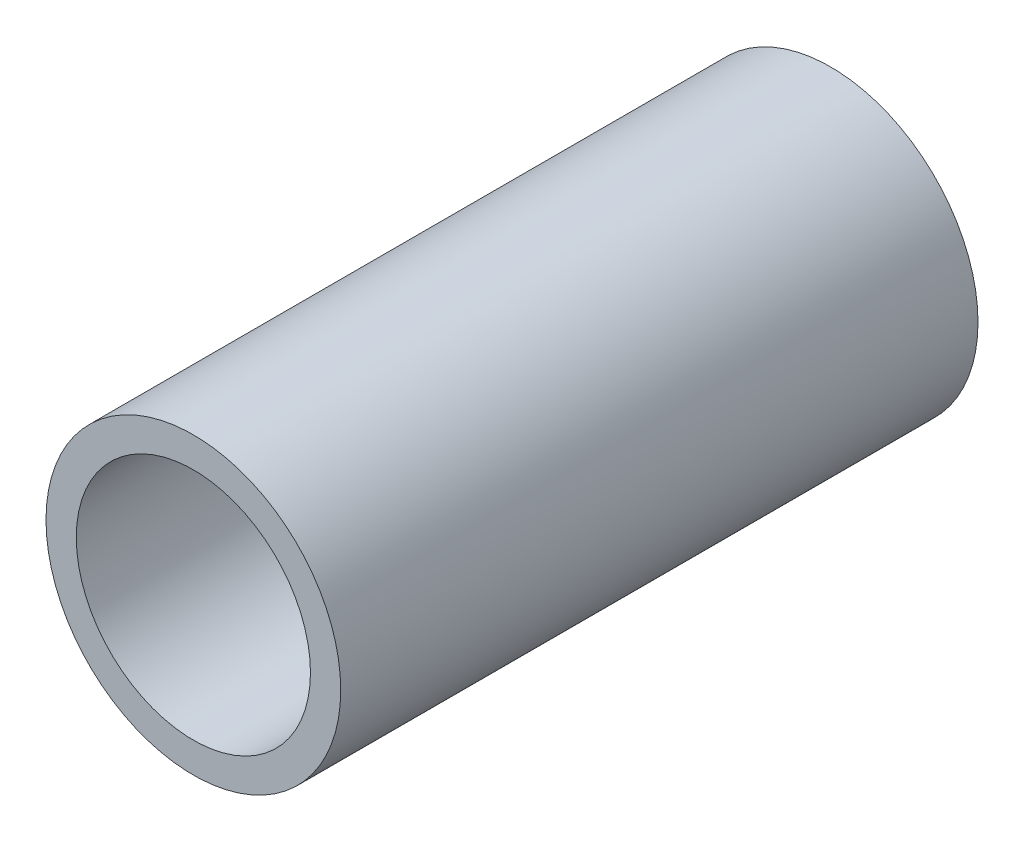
ISO-10303-21;
HEADER;
FILE_DESCRIPTION(('STEP AP214'),'2;1');
FILE_NAME('part.step','',(''),(''),'','','');
FILE_SCHEMA(('AUTOMOTIVE_DESIGN { 1 0 10303 214 1 1 1 1 }'));
ENDSEC;
DATA;
#1=APPLICATION_CONTEXT('core data for automotive mechanical design processes');
#2=APPLICATION_PROTOCOL_DEFINITION('international standard','automotive_design',2000,#1);
#3=PRODUCT_CONTEXT('',#1,'mechanical');
#4=PRODUCT('Part','Part','',(#3));
#5=PRODUCT_RELATED_PRODUCT_CATEGORY('part','',(#4));
#6=PRODUCT_DEFINITION_FORMATION('','',#4);
#7=PRODUCT_DEFINITION_CONTEXT('part definition',#1,'design');
#8=PRODUCT_DEFINITION('design','',#6,#7);
#9=PRODUCT_DEFINITION_SHAPE('','',#8);
#10=(LENGTH_UNIT() NAMED_UNIT(*) SI_UNIT(.MILLI.,.METRE.));
#11=(NAMED_UNIT(*) PLANE_ANGLE_UNIT() SI_UNIT($,.RADIAN.));
#12=(NAMED_UNIT(*) SI_UNIT($,.STERADIAN.) SOLID_ANGLE_UNIT());
#13=UNCERTAINTY_MEASURE_WITH_UNIT(LENGTH_MEASURE(1.E-05),#10,'distance_accuracy_value','');
#14=(GEOMETRIC_REPRESENTATION_CONTEXT(3) GLOBAL_UNCERTAINTY_ASSIGNED_CONTEXT((#13)) GLOBAL_UNIT_ASSIGNED_CONTEXT((#10,
#11,#12)) REPRESENTATION_CONTEXT('',''));
#15=CARTESIAN_POINT('',(0.,0.,0.));
#16=DIRECTION('',(0.,0.,1.));
#17=DIRECTION('',(1.,0.,0.));
#18=AXIS2_PLACEMENT_3D('',#15,#16,#17);
#19=CARTESIAN_POINT('',(0.,0.,40.));
#20=DIRECTION('',(0.,0.,1.));
#21=DIRECTION('',(1.,0.,0.));
#22=AXIS2_PLACEMENT_3D('',#19,#20,#21);
#23=PLANE('',#22);
#24=CARTESIAN_POINT('',(0.,0.,40.));
#25=DIRECTION('',(0.,0.,1.));
#26=DIRECTION('',(1.,0.,0.));
#27=AXIS2_PLACEMENT_3D('',#24,#25,#26);
#28=CIRCLE('',#27,9.25);
#29=CARTESIAN_POINT('',(9.25,0.,40.));
#30=VERTEX_POINT('',#29);
#31=EDGE_CURVE('E10',#30,#30,#28,.T.);
#32=ORIENTED_EDGE('',*,*,#31,.T.);
#33=EDGE_LOOP('',(#32));
#34=FACE_BOUND('',#33,.T.);
#35=CARTESIAN_POINT('',(0.,0.,40.));
#36=DIRECTION('',(0.,0.,1.));
#37=DIRECTION('',(1.,0.,0.));
#38=AXIS2_PLACEMENT_3D('',#35,#36,#37);
#39=CIRCLE('',#38,7.35);
#40=CARTESIAN_POINT('',(7.35,0.,40.));
#41=VERTEX_POINT('',#40);
#42=EDGE_CURVE('E43',#41,#41,#39,.T.);
#43=ORIENTED_EDGE('',*,*,#42,.F.);
#44=EDGE_LOOP('',(#43));
#45=FACE_BOUND('',#44,.T.);
#46=ADVANCED_FACE('F32',(#34,#45),#23,.T.);
#47=CARTESIAN_POINT('',(0.,0.,0.));
#48=DIRECTION('',(0.,0.,1.));
#49=DIRECTION('',(1.,0.,0.));
#50=AXIS2_PLACEMENT_3D('',#47,#48,#49);
#51=PLANE('',#50);
#52=CARTESIAN_POINT('',(0.,0.,0.));
#53=DIRECTION('',(0.,0.,1.));
#54=DIRECTION('',(1.,0.,0.));
#55=AXIS2_PLACEMENT_3D('',#52,#53,#54);
#56=CIRCLE('',#55,9.25);
#57=CARTESIAN_POINT('',(9.25,0.,0.));
#58=VERTEX_POINT('',#57);
#59=EDGE_CURVE('E36',#58,#58,#56,.T.);
#60=ORIENTED_EDGE('',*,*,#59,.F.);
#61=EDGE_LOOP('',(#60));
#62=FACE_BOUND('',#61,.T.);
#63=CARTESIAN_POINT('',(0.,0.,0.));
#64=DIRECTION('',(0.,0.,1.));
#65=DIRECTION('',(1.,0.,0.));
#66=AXIS2_PLACEMENT_3D('',#63,#64,#65);
#67=CIRCLE('',#66,7.35);
#68=CARTESIAN_POINT('',(7.35,0.,0.));
#69=VERTEX_POINT('',#68);
#70=EDGE_CURVE('E45',#69,#69,#67,.T.);
#71=ORIENTED_EDGE('',*,*,#70,.T.);
#72=EDGE_LOOP('',(#71));
#73=FACE_BOUND('',#72,.T.);
#74=ADVANCED_FACE('F55',(#62,#73),#51,.F.);
#75=CARTESIAN_POINT('',(0.,0.,40.));
#76=DIRECTION('',(0.,0.,-1.));
#77=DIRECTION('',(-1.,0.,0.));
#78=AXIS2_PLACEMENT_3D('',#75,#76,#77);
#79=CYLINDRICAL_SURFACE('',#78,9.25);
#80=ORIENTED_EDGE('',*,*,#31,.F.);
#81=EDGE_LOOP('',(#80));
#82=FACE_BOUND('',#81,.T.);
#83=ORIENTED_EDGE('',*,*,#59,.T.);
#84=EDGE_LOOP('',(#83));
#85=FACE_BOUND('',#84,.T.);
#86=ADVANCED_FACE('F34',(#82,#85),#79,.T.);
#87=CARTESIAN_POINT('',(0.,0.,40.));
#88=DIRECTION('',(0.,0.,-1.));
#89=DIRECTION('',(-1.,0.,0.));
#90=AXIS2_PLACEMENT_3D('',#87,#88,#89);
#91=CYLINDRICAL_SURFACE('',#90,7.35);
#92=ORIENTED_EDGE('',*,*,#42,.T.);
#93=EDGE_LOOP('',(#92));
#94=FACE_BOUND('',#93,.T.);
#95=ORIENTED_EDGE('',*,*,#70,.F.);
#96=EDGE_LOOP('',(#95));
#97=FACE_BOUND('',#96,.T.);
#98=ADVANCED_FACE('F51',(#94,#97),#91,.F.);
#99=CLOSED_SHELL('',(#46,#74,#86,#98));
#100=MANIFOLD_SOLID_BREP('B2',#99);
#101=ADVANCED_BREP_SHAPE_REPRESENTATION('',(#18,#100),#14);
#102=SHAPE_DEFINITION_REPRESENTATION(#9,#101);
ENDSEC;
END-ISO-10303-21;
